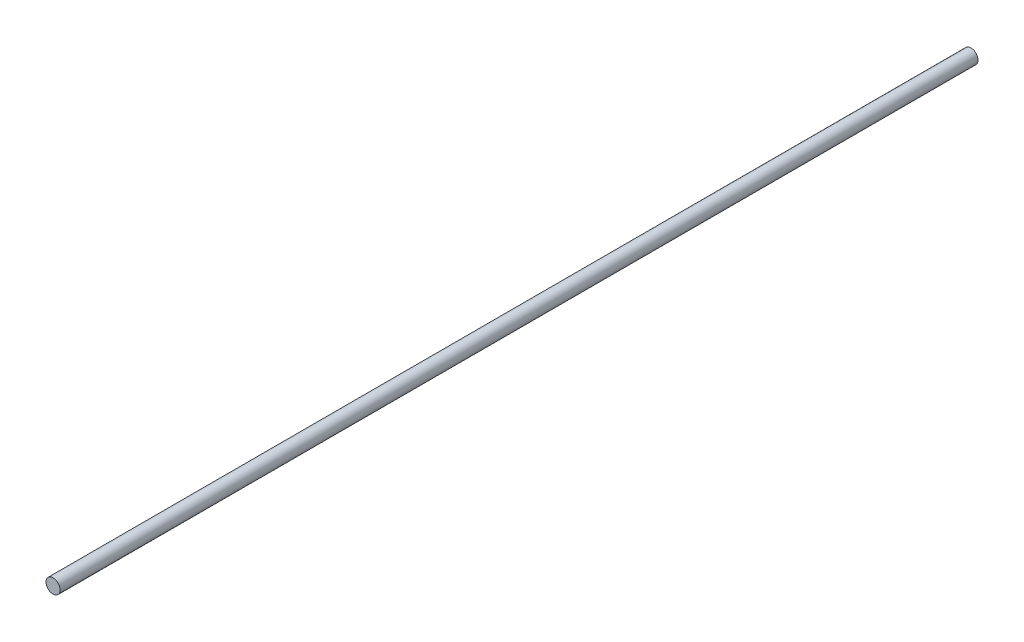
from build123d import *

# Parameters (mm, degrees)
SKETCH1_R           = 30
BOSS_EXTRUDE1_DEPTH = 3900


with BuildPart() as part:
    # Sketch1 → Boss-Extrude1 (new body)
    with BuildSketch(Plane.XY):
        Circle(SKETCH1_R)
    extrude(amount=-BOSS_EXTRUDE1_DEPTH)


solid = part.part
